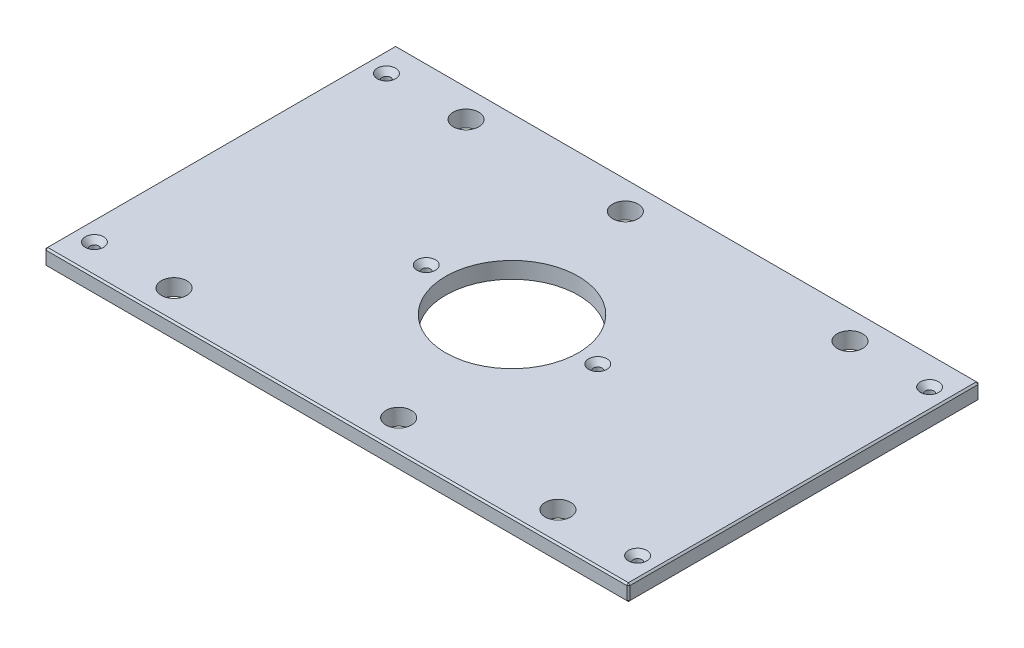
ISO-10303-21;
HEADER;
FILE_DESCRIPTION(('STEP AP214'),'2;1');
FILE_NAME('part.step','',(''),(''),'','','');
FILE_SCHEMA(('AUTOMOTIVE_DESIGN { 1 0 10303 214 1 1 1 1 }'));
ENDSEC;
DATA;
#1=APPLICATION_CONTEXT('core data for automotive mechanical design processes');
#2=APPLICATION_PROTOCOL_DEFINITION('international standard','automotive_design',2000,#1);
#3=PRODUCT_CONTEXT('',#1,'mechanical');
#4=PRODUCT('Part','Part','',(#3));
#5=PRODUCT_RELATED_PRODUCT_CATEGORY('part','',(#4));
#6=PRODUCT_DEFINITION_FORMATION('','',#4);
#7=PRODUCT_DEFINITION_CONTEXT('part definition',#1,'design');
#8=PRODUCT_DEFINITION('design','',#6,#7);
#9=PRODUCT_DEFINITION_SHAPE('','',#8);
#10=(LENGTH_UNIT() NAMED_UNIT(*) SI_UNIT(.MILLI.,.METRE.));
#11=(NAMED_UNIT(*) PLANE_ANGLE_UNIT() SI_UNIT($,.RADIAN.));
#12=(NAMED_UNIT(*) SI_UNIT($,.STERADIAN.) SOLID_ANGLE_UNIT());
#13=UNCERTAINTY_MEASURE_WITH_UNIT(LENGTH_MEASURE(1.E-05),#10,'distance_accuracy_value','');
#14=(GEOMETRIC_REPRESENTATION_CONTEXT(3) GLOBAL_UNCERTAINTY_ASSIGNED_CONTEXT((#13)) GLOBAL_UNIT_ASSIGNED_CONTEXT((#10,
#11,#12)) REPRESENTATION_CONTEXT('',''));
#15=CARTESIAN_POINT('',(0.,0.,0.));
#16=DIRECTION('',(0.,0.,1.));
#17=DIRECTION('',(1.,0.,0.));
#18=AXIS2_PLACEMENT_3D('',#15,#16,#17);
#19=CARTESIAN_POINT('',(-227.0125,12.7,-136.525));
#20=DIRECTION('',(1.,0.,0.));
#21=DIRECTION('',(0.,0.,-1.));
#22=AXIS2_PLACEMENT_3D('',#19,#20,#21);
#23=PLANE('',#22);
#24=DIRECTION('',(0.,0.,-1.));
#25=VECTOR('',#24,1.);
#26=CARTESIAN_POINT('',(-227.0125,11.4300000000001,-136.525));
#27=LINE('',#26,#25);
#28=CARTESIAN_POINT('',(-227.0125,11.4300000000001,135.255));
#29=VERTEX_POINT('',#28);
#30=CARTESIAN_POINT('',(-227.0125,11.4300000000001,-135.255));
#31=VERTEX_POINT('',#30);
#32=EDGE_CURVE('E135',#29,#31,#27,.T.);
#33=ORIENTED_EDGE('',*,*,#32,.T.);
#34=DIRECTION('',(0.,-1.,0.));
#35=VECTOR('',#34,1.);
#36=CARTESIAN_POINT('',(-227.0125,12.7,-135.255));
#37=LINE('',#36,#35);
#38=CARTESIAN_POINT('',(-227.0125,1.26999999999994,-135.255));
#39=VERTEX_POINT('',#38);
#40=EDGE_CURVE('E131',#31,#39,#37,.T.);
#41=ORIENTED_EDGE('',*,*,#40,.T.);
#42=DIRECTION('',(0.,0.,1.));
#43=VECTOR('',#42,1.);
#44=CARTESIAN_POINT('',(-227.0125,1.26999999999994,-136.525));
#45=LINE('',#44,#43);
#46=CARTESIAN_POINT('',(-227.0125,1.26999999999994,135.255));
#47=VERTEX_POINT('',#46);
#48=EDGE_CURVE('E126',#39,#47,#45,.T.);
#49=ORIENTED_EDGE('',*,*,#48,.T.);
#50=DIRECTION('',(0.,1.,0.));
#51=VECTOR('',#50,1.);
#52=CARTESIAN_POINT('',(-227.0125,12.7,135.255));
#53=LINE('',#52,#51);
#54=EDGE_CURVE('E128',#47,#29,#53,.T.);
#55=ORIENTED_EDGE('',*,*,#54,.T.);
#56=EDGE_LOOP('',(#33,#41,#49,#55));
#57=FACE_BOUND('',#56,.T.);
#58=ADVANCED_FACE('F35',(#57),#23,.F.);
#59=CARTESIAN_POINT('',(-227.0125,12.7,136.525));
#60=DIRECTION('',(0.,0.,-1.));
#61=DIRECTION('',(-1.,0.,0.));
#62=AXIS2_PLACEMENT_3D('',#59,#60,#61);
#63=PLANE('',#62);
#64=DIRECTION('',(1.,0.,0.));
#65=VECTOR('',#64,1.);
#66=CARTESIAN_POINT('',(-227.0125,1.26999999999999,136.525));
#67=LINE('',#66,#65);
#68=CARTESIAN_POINT('',(-225.7425,1.26999999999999,136.525));
#69=VERTEX_POINT('',#68);
#70=CARTESIAN_POINT('',(225.7425,1.26999999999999,136.525));
#71=VERTEX_POINT('',#70);
#72=EDGE_CURVE('E58',#69,#71,#67,.T.);
#73=ORIENTED_EDGE('',*,*,#72,.T.);
#74=DIRECTION('',(0.,1.,0.));
#75=VECTOR('',#74,1.);
#76=CARTESIAN_POINT('',(225.7425,12.7,136.525));
#77=LINE('',#76,#75);
#78=CARTESIAN_POINT('',(225.7425,11.43,136.525));
#79=VERTEX_POINT('',#78);
#80=EDGE_CURVE('E11',#71,#79,#77,.T.);
#81=ORIENTED_EDGE('',*,*,#80,.T.);
#82=DIRECTION('',(-1.,0.,0.));
#83=VECTOR('',#82,1.);
#84=CARTESIAN_POINT('',(-227.0125,11.43,136.525));
#85=LINE('',#84,#83);
#86=CARTESIAN_POINT('',(-225.7425,11.43,136.525));
#87=VERTEX_POINT('',#86);
#88=EDGE_CURVE('E44',#79,#87,#85,.T.);
#89=ORIENTED_EDGE('',*,*,#88,.T.);
#90=DIRECTION('',(0.,-1.,0.));
#91=VECTOR('',#90,1.);
#92=CARTESIAN_POINT('',(-225.7425,12.7,136.525));
#93=LINE('',#92,#91);
#94=EDGE_CURVE('E291',#87,#69,#93,.T.);
#95=ORIENTED_EDGE('',*,*,#94,.T.);
#96=EDGE_LOOP('',(#73,#81,#89,#95));
#97=FACE_BOUND('',#96,.T.);
#98=ADVANCED_FACE('F360',(#97),#63,.F.);
#99=CARTESIAN_POINT('',(227.0125,12.7,-136.525));
#100=DIRECTION('',(-1.,0.,0.));
#101=DIRECTION('',(0.,0.,1.));
#102=AXIS2_PLACEMENT_3D('',#99,#100,#101);
#103=PLANE('',#102);
#104=DIRECTION('',(0.,0.,-1.));
#105=VECTOR('',#104,1.);
#106=CARTESIAN_POINT('',(227.0125,1.26999999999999,-136.525));
#107=LINE('',#106,#105);
#108=CARTESIAN_POINT('',(227.0125,1.26999999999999,135.255));
#109=VERTEX_POINT('',#108);
#110=CARTESIAN_POINT('',(227.0125,1.26999999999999,-135.255));
#111=VERTEX_POINT('',#110);
#112=EDGE_CURVE('E286',#109,#111,#107,.T.);
#113=ORIENTED_EDGE('',*,*,#112,.T.);
#114=DIRECTION('',(0.,1.,0.));
#115=VECTOR('',#114,1.);
#116=CARTESIAN_POINT('',(227.0125,12.7,-135.255));
#117=LINE('',#116,#115);
#118=CARTESIAN_POINT('',(227.0125,11.4300000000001,-135.255));
#119=VERTEX_POINT('',#118);
#120=EDGE_CURVE('E288',#111,#119,#117,.T.);
#121=ORIENTED_EDGE('',*,*,#120,.T.);
#122=DIRECTION('',(0.,0.,1.));
#123=VECTOR('',#122,1.);
#124=CARTESIAN_POINT('',(227.0125,11.4300000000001,136.525));
#125=LINE('',#124,#123);
#126=CARTESIAN_POINT('',(227.0125,11.4300000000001,135.255));
#127=VERTEX_POINT('',#126);
#128=EDGE_CURVE('E284',#119,#127,#125,.T.);
#129=ORIENTED_EDGE('',*,*,#128,.T.);
#130=DIRECTION('',(0.,-1.,0.));
#131=VECTOR('',#130,1.);
#132=CARTESIAN_POINT('',(227.0125,12.7,135.255));
#133=LINE('',#132,#131);
#134=EDGE_CURVE('E282',#127,#109,#133,.T.);
#135=ORIENTED_EDGE('',*,*,#134,.T.);
#136=EDGE_LOOP('',(#113,#121,#129,#135));
#137=FACE_BOUND('',#136,.T.);
#138=ADVANCED_FACE('F347',(#137),#103,.F.);
#139=CARTESIAN_POINT('',(-227.0125,12.7,-136.525));
#140=DIRECTION('',(0.,0.,1.));
#141=DIRECTION('',(1.,0.,0.));
#142=AXIS2_PLACEMENT_3D('',#139,#140,#141);
#143=PLANE('',#142);
#144=DIRECTION('',(-1.,0.,0.));
#145=VECTOR('',#144,1.);
#146=CARTESIAN_POINT('',(-227.0125,1.26999999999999,-136.525));
#147=LINE('',#146,#145);
#148=CARTESIAN_POINT('',(225.7425,1.26999999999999,-136.525));
#149=VERTEX_POINT('',#148);
#150=CARTESIAN_POINT('',(-225.7425,1.26999999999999,-136.525));
#151=VERTEX_POINT('',#150);
#152=EDGE_CURVE('E258',#149,#151,#147,.T.);
#153=ORIENTED_EDGE('',*,*,#152,.T.);
#154=DIRECTION('',(0.,1.,0.));
#155=VECTOR('',#154,1.);
#156=CARTESIAN_POINT('',(-225.7425,12.7,-136.525));
#157=LINE('',#156,#155);
#158=CARTESIAN_POINT('',(-225.7425,11.4300000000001,-136.525));
#159=VERTEX_POINT('',#158);
#160=EDGE_CURVE('E262',#151,#159,#157,.T.);
#161=ORIENTED_EDGE('',*,*,#160,.T.);
#162=DIRECTION('',(1.,0.,0.));
#163=VECTOR('',#162,1.);
#164=CARTESIAN_POINT('',(227.0125,11.4300000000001,-136.525));
#165=LINE('',#164,#163);
#166=CARTESIAN_POINT('',(225.7425,11.4300000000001,-136.525));
#167=VERTEX_POINT('',#166);
#168=EDGE_CURVE('E260',#159,#167,#165,.T.);
#169=ORIENTED_EDGE('',*,*,#168,.T.);
#170=DIRECTION('',(0.,-1.,0.));
#171=VECTOR('',#170,1.);
#172=CARTESIAN_POINT('',(225.7425,12.7,-136.525));
#173=LINE('',#172,#171);
#174=EDGE_CURVE('E256',#167,#149,#173,.T.);
#175=ORIENTED_EDGE('',*,*,#174,.T.);
#176=EDGE_LOOP('',(#153,#161,#169,#175));
#177=FACE_BOUND('',#176,.T.);
#178=ADVANCED_FACE('F321',(#177),#143,.F.);
#179=CARTESIAN_POINT('',(0.,12.7,0.));
#180=DIRECTION('',(0.,1.,0.));
#181=DIRECTION('',(0.,0.,1.));
#182=AXIS2_PLACEMENT_3D('',#179,#180,#181);
#183=PLANE('',#182);
#184=CARTESIAN_POINT('',(211.1375,12.7,-113.50498));
#185=DIRECTION('',(0.,1.,0.));
#186=DIRECTION('',(0.,0.,1.));
#187=AXIS2_PLACEMENT_3D('',#184,#185,#186);
#188=CIRCLE('',#187,7.13739999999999);
#189=CARTESIAN_POINT('',(211.1375,12.7,-106.36758));
#190=VERTEX_POINT('',#189);
#191=EDGE_CURVE('E784',#190,#190,#188,.T.);
#192=ORIENTED_EDGE('',*,*,#191,.F.);
#193=EDGE_LOOP('',(#192));
#194=FACE_BOUND('',#193,.T.);
#195=CARTESIAN_POINT('',(211.1375,12.7,113.50498));
#196=DIRECTION('',(0.,1.,0.));
#197=DIRECTION('',(0.,0.,1.));
#198=AXIS2_PLACEMENT_3D('',#195,#196,#197);
#199=CIRCLE('',#198,7.13739999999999);
#200=CARTESIAN_POINT('',(211.1375,12.7,120.64238));
#201=VERTEX_POINT('',#200);
#202=EDGE_CURVE('E788',#201,#201,#199,.T.);
#203=ORIENTED_EDGE('',*,*,#202,.F.);
#204=EDGE_LOOP('',(#203));
#205=FACE_BOUND('',#204,.T.);
#206=CARTESIAN_POINT('',(-211.1375,12.7,113.50498));
#207=DIRECTION('',(0.,1.,0.));
#208=DIRECTION('',(0.,0.,1.));
#209=AXIS2_PLACEMENT_3D('',#206,#207,#208);
#210=CIRCLE('',#209,7.13739999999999);
#211=CARTESIAN_POINT('',(-211.1375,12.7,120.64238));
#212=VERTEX_POINT('',#211);
#213=EDGE_CURVE('E792',#212,#212,#210,.T.);
#214=ORIENTED_EDGE('',*,*,#213,.F.);
#215=EDGE_LOOP('',(#214));
#216=FACE_BOUND('',#215,.T.);
#217=CARTESIAN_POINT('',(-66.675,12.7,0.));
#218=DIRECTION('',(0.,1.,0.));
#219=DIRECTION('',(0.,0.,1.));
#220=AXIS2_PLACEMENT_3D('',#217,#218,#219);
#221=CIRCLE('',#220,7.1374);
#222=CARTESIAN_POINT('',(-66.675,12.7,7.1374));
#223=VERTEX_POINT('',#222);
#224=EDGE_CURVE('E796',#223,#223,#221,.T.);
#225=ORIENTED_EDGE('',*,*,#224,.F.);
#226=EDGE_LOOP('',(#225));
#227=FACE_BOUND('',#226,.T.);
#228=CARTESIAN_POINT('',(66.675,12.7,0.));
#229=DIRECTION('',(0.,1.,0.));
#230=DIRECTION('',(0.,0.,1.));
#231=AXIS2_PLACEMENT_3D('',#228,#229,#230);
#232=CIRCLE('',#231,7.1374);
#233=CARTESIAN_POINT('',(66.675,12.7,7.1374));
#234=VERTEX_POINT('',#233);
#235=EDGE_CURVE('E800',#234,#234,#232,.T.);
#236=ORIENTED_EDGE('',*,*,#235,.F.);
#237=EDGE_LOOP('',(#236));
#238=FACE_BOUND('',#237,.T.);
#239=CARTESIAN_POINT('',(-211.1375,12.7,-113.50498));
#240=DIRECTION('',(0.,1.,0.));
#241=DIRECTION('',(0.,0.,1.));
#242=AXIS2_PLACEMENT_3D('',#239,#240,#241);
#243=CIRCLE('',#242,7.13739999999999);
#244=CARTESIAN_POINT('',(-211.1375,12.7,-106.36758));
#245=VERTEX_POINT('',#244);
#246=EDGE_CURVE('E803',#245,#245,#243,.T.);
#247=ORIENTED_EDGE('',*,*,#246,.F.);
#248=EDGE_LOOP('',(#247));
#249=FACE_BOUND('',#248,.T.);
#250=DIRECTION('',(0.,0.,-1.));
#251=VECTOR('',#250,1.);
#252=CARTESIAN_POINT('',(225.7425,12.7,-136.525));
#253=LINE('',#252,#251);
#254=CARTESIAN_POINT('',(225.7425,12.7,135.255));
#255=VERTEX_POINT('',#254);
#256=CARTESIAN_POINT('',(225.7425,12.7,-135.255));
#257=VERTEX_POINT('',#256);
#258=EDGE_CURVE('E269',#255,#257,#253,.T.);
#259=ORIENTED_EDGE('',*,*,#258,.T.);
#260=DIRECTION('',(-1.,0.,0.));
#261=VECTOR('',#260,1.);
#262=CARTESIAN_POINT('',(-227.0125,12.7,-135.255));
#263=LINE('',#262,#261);
#264=CARTESIAN_POINT('',(-225.7425,12.7,-135.255));
#265=VERTEX_POINT('',#264);
#266=EDGE_CURVE('E271',#257,#265,#263,.T.);
#267=ORIENTED_EDGE('',*,*,#266,.T.);
#268=DIRECTION('',(0.,0.,1.));
#269=VECTOR('',#268,1.);
#270=CARTESIAN_POINT('',(-225.7425,12.7,136.525));
#271=LINE('',#270,#269);
#272=CARTESIAN_POINT('',(-225.7425,12.7,135.255));
#273=VERTEX_POINT('',#272);
#274=EDGE_CURVE('E267',#265,#273,#271,.T.);
#275=ORIENTED_EDGE('',*,*,#274,.T.);
#276=DIRECTION('',(1.,0.,0.));
#277=VECTOR('',#276,1.);
#278=CARTESIAN_POINT('',(227.0125,12.7,135.255));
#279=LINE('',#278,#277);
#280=EDGE_CURVE('E265',#273,#255,#279,.T.);
#281=ORIENTED_EDGE('',*,*,#280,.T.);
#282=EDGE_LOOP('',(#259,#267,#275,#281));
#283=FACE_BOUND('',#282,.T.);
#284=CARTESIAN_POINT('',(149.225,12.7,-113.50498));
#285=DIRECTION('',(0.,1.,0.));
#286=DIRECTION('',(0.,0.,1.));
#287=AXIS2_PLACEMENT_3D('',#284,#285,#286);
#288=CIRCLE('',#287,9.921875);
#289=CARTESIAN_POINT('',(149.225,12.7,-103.583105));
#290=VERTEX_POINT('',#289);
#291=EDGE_CURVE('E204',#290,#290,#288,.T.);
#292=ORIENTED_EDGE('',*,*,#291,.F.);
#293=EDGE_LOOP('',(#292));
#294=FACE_BOUND('',#293,.T.);
#295=CARTESIAN_POINT('',(-149.225,12.7,-113.50498));
#296=DIRECTION('',(0.,1.,0.));
#297=DIRECTION('',(0.,0.,1.));
#298=AXIS2_PLACEMENT_3D('',#295,#296,#297);
#299=CIRCLE('',#298,9.921875);
#300=CARTESIAN_POINT('',(-149.225,12.7,-103.583105));
#301=VERTEX_POINT('',#300);
#302=EDGE_CURVE('E214',#301,#301,#299,.T.);
#303=ORIENTED_EDGE('',*,*,#302,.F.);
#304=EDGE_LOOP('',(#303));
#305=FACE_BOUND('',#304,.T.);
#306=CARTESIAN_POINT('',(149.225,12.7,113.50498));
#307=DIRECTION('',(0.,1.,0.));
#308=DIRECTION('',(0.,0.,1.));
#309=AXIS2_PLACEMENT_3D('',#306,#307,#308);
#310=CIRCLE('',#309,9.921875);
#311=CARTESIAN_POINT('',(149.225,12.7,123.426855));
#312=VERTEX_POINT('',#311);
#313=EDGE_CURVE('E225',#312,#312,#310,.T.);
#314=ORIENTED_EDGE('',*,*,#313,.F.);
#315=EDGE_LOOP('',(#314));
#316=FACE_BOUND('',#315,.T.);
#317=CARTESIAN_POINT('',(-149.225,12.7,113.50498));
#318=DIRECTION('',(0.,1.,0.));
#319=DIRECTION('',(0.,0.,1.));
#320=AXIS2_PLACEMENT_3D('',#317,#318,#319);
#321=CIRCLE('',#320,9.921875);
#322=CARTESIAN_POINT('',(-149.225,12.7,123.426855));
#323=VERTEX_POINT('',#322);
#324=EDGE_CURVE('E231',#323,#323,#321,.T.);
#325=ORIENTED_EDGE('',*,*,#324,.F.);
#326=EDGE_LOOP('',(#325));
#327=FACE_BOUND('',#326,.T.);
#328=CARTESIAN_POINT('',(-25.4,12.7,-113.50498));
#329=DIRECTION('',(0.,1.,0.));
#330=DIRECTION('',(0.,0.,1.));
#331=AXIS2_PLACEMENT_3D('',#328,#329,#330);
#332=CIRCLE('',#331,9.921875);
#333=CARTESIAN_POINT('',(-25.4,12.7,-103.583105));
#334=VERTEX_POINT('',#333);
#335=EDGE_CURVE('E237',#334,#334,#332,.T.);
#336=ORIENTED_EDGE('',*,*,#335,.F.);
#337=EDGE_LOOP('',(#336));
#338=FACE_BOUND('',#337,.T.);
#339=CARTESIAN_POINT('',(25.4,12.7,113.50498));
#340=DIRECTION('',(0.,1.,0.));
#341=DIRECTION('',(0.,0.,1.));
#342=AXIS2_PLACEMENT_3D('',#339,#340,#341);
#343=CIRCLE('',#342,9.921875);
#344=CARTESIAN_POINT('',(25.4,12.7,123.426855));
#345=VERTEX_POINT('',#344);
#346=EDGE_CURVE('E243',#345,#345,#343,.T.);
#347=ORIENTED_EDGE('',*,*,#346,.F.);
#348=EDGE_LOOP('',(#347));
#349=FACE_BOUND('',#348,.T.);
#350=CARTESIAN_POINT('',(0.,12.7,0.));
#351=DIRECTION('',(0.,1.,0.));
#352=DIRECTION('',(0.,0.,1.));
#353=AXIS2_PLACEMENT_3D('',#350,#351,#352);
#354=CIRCLE('',#353,51.562);
#355=CARTESIAN_POINT('',(0.,12.7,51.562));
#356=VERTEX_POINT('',#355);
#357=EDGE_CURVE('E249',#356,#356,#354,.T.);
#358=ORIENTED_EDGE('',*,*,#357,.F.);
#359=EDGE_LOOP('',(#358));
#360=FACE_BOUND('',#359,.T.);
#361=ADVANCED_FACE('F369',(#194,#205,#216,#227,#238,#249,#283,#294,#305,#316,#327,#338,#349,
#360),#183,.T.);
#362=CARTESIAN_POINT('',(0.,0.,0.));
#363=DIRECTION('',(0.,1.,0.));
#364=DIRECTION('',(0.,0.,1.));
#365=AXIS2_PLACEMENT_3D('',#362,#363,#364);
#366=PLANE('',#365);
#367=CARTESIAN_POINT('',(211.1375,0.,-113.50498));
#368=DIRECTION('',(0.,1.,0.));
#369=DIRECTION('',(0.,0.,1.));
#370=AXIS2_PLACEMENT_3D('',#367,#368,#369);
#371=CIRCLE('',#370,3.3782);
#372=CARTESIAN_POINT('',(211.1375,0.,-110.12678));
#373=VERTEX_POINT('',#372);
#374=EDGE_CURVE('E837',#373,#373,#371,.T.);
#375=ORIENTED_EDGE('',*,*,#374,.T.);
#376=EDGE_LOOP('',(#375));
#377=FACE_BOUND('',#376,.T.);
#378=CARTESIAN_POINT('',(211.1375,0.,113.50498));
#379=DIRECTION('',(0.,1.,0.));
#380=DIRECTION('',(0.,0.,1.));
#381=AXIS2_PLACEMENT_3D('',#378,#379,#380);
#382=CIRCLE('',#381,3.3782);
#383=CARTESIAN_POINT('',(211.1375,0.,116.88318));
#384=VERTEX_POINT('',#383);
#385=EDGE_CURVE('E830',#384,#384,#382,.T.);
#386=ORIENTED_EDGE('',*,*,#385,.T.);
#387=EDGE_LOOP('',(#386));
#388=FACE_BOUND('',#387,.T.);
#389=CARTESIAN_POINT('',(-211.1375,0.,113.50498));
#390=DIRECTION('',(0.,1.,0.));
#391=DIRECTION('',(0.,0.,1.));
#392=AXIS2_PLACEMENT_3D('',#389,#390,#391);
#393=CIRCLE('',#392,3.3782);
#394=CARTESIAN_POINT('',(-211.1375,0.,116.88318));
#395=VERTEX_POINT('',#394);
#396=EDGE_CURVE('E823',#395,#395,#393,.T.);
#397=ORIENTED_EDGE('',*,*,#396,.T.);
#398=EDGE_LOOP('',(#397));
#399=FACE_BOUND('',#398,.T.);
#400=CARTESIAN_POINT('',(-66.675,0.,0.));
#401=DIRECTION('',(0.,1.,0.));
#402=DIRECTION('',(0.,0.,1.));
#403=AXIS2_PLACEMENT_3D('',#400,#401,#402);
#404=CIRCLE('',#403,3.3782);
#405=CARTESIAN_POINT('',(-66.675,0.,3.3782));
#406=VERTEX_POINT('',#405);
#407=EDGE_CURVE('E816',#406,#406,#404,.T.);
#408=ORIENTED_EDGE('',*,*,#407,.T.);
#409=EDGE_LOOP('',(#408));
#410=FACE_BOUND('',#409,.T.);
#411=CARTESIAN_POINT('',(66.675,0.,0.));
#412=DIRECTION('',(0.,1.,0.));
#413=DIRECTION('',(0.,0.,1.));
#414=AXIS2_PLACEMENT_3D('',#411,#412,#413);
#415=CIRCLE('',#414,3.3782);
#416=CARTESIAN_POINT('',(66.675,0.,3.3782));
#417=VERTEX_POINT('',#416);
#418=EDGE_CURVE('E806',#417,#417,#415,.T.);
#419=ORIENTED_EDGE('',*,*,#418,.T.);
#420=EDGE_LOOP('',(#419));
#421=FACE_BOUND('',#420,.T.);
#422=CARTESIAN_POINT('',(-211.1375,0.,-113.50498));
#423=DIRECTION('',(0.,1.,0.));
#424=DIRECTION('',(0.,0.,1.));
#425=AXIS2_PLACEMENT_3D('',#422,#423,#424);
#426=CIRCLE('',#425,3.3782);
#427=CARTESIAN_POINT('',(-211.1375,0.,-110.12678));
#428=VERTEX_POINT('',#427);
#429=EDGE_CURVE('E217',#428,#428,#426,.T.);
#430=ORIENTED_EDGE('',*,*,#429,.T.);
#431=EDGE_LOOP('',(#430));
#432=FACE_BOUND('',#431,.T.);
#433=DIRECTION('',(0.,0.,-1.));
#434=VECTOR('',#433,1.);
#435=CARTESIAN_POINT('',(-225.7425,0.,0.));
#436=LINE('',#435,#434);
#437=CARTESIAN_POINT('',(-225.7425,0.,135.255));
#438=VERTEX_POINT('',#437);
#439=CARTESIAN_POINT('',(-225.7425,0.,-135.255));
#440=VERTEX_POINT('',#439);
#441=EDGE_CURVE('E158',#438,#440,#436,.T.);
#442=ORIENTED_EDGE('',*,*,#441,.T.);
#443=DIRECTION('',(1.,0.,0.));
#444=VECTOR('',#443,1.);
#445=CARTESIAN_POINT('',(0.,0.,-135.255));
#446=LINE('',#445,#444);
#447=CARTESIAN_POINT('',(225.7425,0.,-135.255));
#448=VERTEX_POINT('',#447);
#449=EDGE_CURVE('E279',#440,#448,#446,.T.);
#450=ORIENTED_EDGE('',*,*,#449,.T.);
#451=DIRECTION('',(0.,0.,1.));
#452=VECTOR('',#451,1.);
#453=CARTESIAN_POINT('',(225.7425,0.,0.));
#454=LINE('',#453,#452);
#455=CARTESIAN_POINT('',(225.7425,0.,135.255));
#456=VERTEX_POINT('',#455);
#457=EDGE_CURVE('E277',#448,#456,#454,.T.);
#458=ORIENTED_EDGE('',*,*,#457,.T.);
#459=DIRECTION('',(-1.,0.,0.));
#460=VECTOR('',#459,1.);
#461=CARTESIAN_POINT('',(0.,0.,135.255));
#462=LINE('',#461,#460);
#463=EDGE_CURVE('E274',#456,#438,#462,.T.);
#464=ORIENTED_EDGE('',*,*,#463,.T.);
#465=EDGE_LOOP('',(#442,#450,#458,#464));
#466=FACE_BOUND('',#465,.T.);
#467=CARTESIAN_POINT('',(149.225,0.,-113.50498));
#468=DIRECTION('',(0.,1.,0.));
#469=DIRECTION('',(0.,0.,1.));
#470=AXIS2_PLACEMENT_3D('',#467,#468,#469);
#471=CIRCLE('',#470,9.921875);
#472=CARTESIAN_POINT('',(149.225,0.,-103.583105));
#473=VERTEX_POINT('',#472);
#474=EDGE_CURVE('E209',#473,#473,#471,.T.);
#475=ORIENTED_EDGE('',*,*,#474,.T.);
#476=EDGE_LOOP('',(#475));
#477=FACE_BOUND('',#476,.T.);
#478=CARTESIAN_POINT('',(-149.225,0.,-113.50498));
#479=DIRECTION('',(0.,1.,0.));
#480=DIRECTION('',(0.,0.,1.));
#481=AXIS2_PLACEMENT_3D('',#478,#479,#480);
#482=CIRCLE('',#481,9.921875);
#483=CARTESIAN_POINT('',(-149.225,0.,-103.583105));
#484=VERTEX_POINT('',#483);
#485=EDGE_CURVE('E222',#484,#484,#482,.T.);
#486=ORIENTED_EDGE('',*,*,#485,.T.);
#487=EDGE_LOOP('',(#486));
#488=FACE_BOUND('',#487,.T.);
#489=CARTESIAN_POINT('',(149.225,0.,113.50498));
#490=DIRECTION('',(0.,1.,0.));
#491=DIRECTION('',(0.,0.,1.));
#492=AXIS2_PLACEMENT_3D('',#489,#490,#491);
#493=CIRCLE('',#492,9.921875);
#494=CARTESIAN_POINT('',(149.225,0.,123.426855));
#495=VERTEX_POINT('',#494);
#496=EDGE_CURVE('E228',#495,#495,#493,.T.);
#497=ORIENTED_EDGE('',*,*,#496,.T.);
#498=EDGE_LOOP('',(#497));
#499=FACE_BOUND('',#498,.T.);
#500=CARTESIAN_POINT('',(-149.225,0.,113.50498));
#501=DIRECTION('',(0.,1.,0.));
#502=DIRECTION('',(0.,0.,1.));
#503=AXIS2_PLACEMENT_3D('',#500,#501,#502);
#504=CIRCLE('',#503,9.921875);
#505=CARTESIAN_POINT('',(-149.225,0.,123.426855));
#506=VERTEX_POINT('',#505);
#507=EDGE_CURVE('E234',#506,#506,#504,.T.);
#508=ORIENTED_EDGE('',*,*,#507,.T.);
#509=EDGE_LOOP('',(#508));
#510=FACE_BOUND('',#509,.T.);
#511=CARTESIAN_POINT('',(-25.4,0.,-113.50498));
#512=DIRECTION('',(0.,1.,0.));
#513=DIRECTION('',(0.,0.,1.));
#514=AXIS2_PLACEMENT_3D('',#511,#512,#513);
#515=CIRCLE('',#514,9.921875);
#516=CARTESIAN_POINT('',(-25.4,0.,-103.583105));
#517=VERTEX_POINT('',#516);
#518=EDGE_CURVE('E240',#517,#517,#515,.T.);
#519=ORIENTED_EDGE('',*,*,#518,.T.);
#520=EDGE_LOOP('',(#519));
#521=FACE_BOUND('',#520,.T.);
#522=CARTESIAN_POINT('',(25.4,0.,113.50498));
#523=DIRECTION('',(0.,1.,0.));
#524=DIRECTION('',(0.,0.,1.));
#525=AXIS2_PLACEMENT_3D('',#522,#523,#524);
#526=CIRCLE('',#525,9.921875);
#527=CARTESIAN_POINT('',(25.4,0.,123.426855));
#528=VERTEX_POINT('',#527);
#529=EDGE_CURVE('E246',#528,#528,#526,.T.);
#530=ORIENTED_EDGE('',*,*,#529,.T.);
#531=EDGE_LOOP('',(#530));
#532=FACE_BOUND('',#531,.T.);
#533=CARTESIAN_POINT('',(0.,0.,0.));
#534=DIRECTION('',(0.,1.,0.));
#535=DIRECTION('',(0.,0.,1.));
#536=AXIS2_PLACEMENT_3D('',#533,#534,#535);
#537=CIRCLE('',#536,51.562);
#538=CARTESIAN_POINT('',(0.,0.,51.562));
#539=VERTEX_POINT('',#538);
#540=EDGE_CURVE('E147',#539,#539,#537,.T.);
#541=ORIENTED_EDGE('',*,*,#540,.T.);
#542=EDGE_LOOP('',(#541));
#543=FACE_BOUND('',#542,.T.);
#544=ADVANCED_FACE('F334',(#377,#388,#399,#410,#421,#432,#466,#477,#488,#499,#510,#521,#532,
#543),#366,.F.);
#545=CARTESIAN_POINT('',(0.,0.,0.));
#546=DIRECTION('',(0.,1.,0.));
#547=DIRECTION('',(0.,0.,1.));
#548=AXIS2_PLACEMENT_3D('',#545,#546,#547);
#549=CYLINDRICAL_SURFACE('',#548,51.562);
#550=ORIENTED_EDGE('',*,*,#540,.F.);
#551=EDGE_LOOP('',(#550));
#552=FACE_BOUND('',#551,.T.);
#553=ORIENTED_EDGE('',*,*,#357,.T.);
#554=EDGE_LOOP('',(#553));
#555=FACE_BOUND('',#554,.T.);
#556=ADVANCED_FACE('F721',(#552,#555),#549,.F.);
#557=CARTESIAN_POINT('',(25.4,12.7,113.50498));
#558=DIRECTION('',(0.,1.,0.));
#559=DIRECTION('',(0.,0.,1.));
#560=AXIS2_PLACEMENT_3D('',#557,#558,#559);
#561=CYLINDRICAL_SURFACE('',#560,9.921875);
#562=ORIENTED_EDGE('',*,*,#529,.F.);
#563=EDGE_LOOP('',(#562));
#564=FACE_BOUND('',#563,.T.);
#565=ORIENTED_EDGE('',*,*,#346,.T.);
#566=EDGE_LOOP('',(#565));
#567=FACE_BOUND('',#566,.T.);
#568=ADVANCED_FACE('F712',(#564,#567),#561,.F.);
#569=CARTESIAN_POINT('',(-25.4,12.7,-113.50498));
#570=DIRECTION('',(0.,1.,0.));
#571=DIRECTION('',(0.,0.,1.));
#572=AXIS2_PLACEMENT_3D('',#569,#570,#571);
#573=CYLINDRICAL_SURFACE('',#572,9.921875);
#574=ORIENTED_EDGE('',*,*,#518,.F.);
#575=EDGE_LOOP('',(#574));
#576=FACE_BOUND('',#575,.T.);
#577=ORIENTED_EDGE('',*,*,#335,.T.);
#578=EDGE_LOOP('',(#577));
#579=FACE_BOUND('',#578,.T.);
#580=ADVANCED_FACE('F703',(#576,#579),#573,.F.);
#581=CARTESIAN_POINT('',(-149.225,12.7,113.50498));
#582=DIRECTION('',(0.,1.,0.));
#583=DIRECTION('',(0.,0.,1.));
#584=AXIS2_PLACEMENT_3D('',#581,#582,#583);
#585=CYLINDRICAL_SURFACE('',#584,9.921875);
#586=ORIENTED_EDGE('',*,*,#507,.F.);
#587=EDGE_LOOP('',(#586));
#588=FACE_BOUND('',#587,.T.);
#589=ORIENTED_EDGE('',*,*,#324,.T.);
#590=EDGE_LOOP('',(#589));
#591=FACE_BOUND('',#590,.T.);
#592=ADVANCED_FACE('F694',(#588,#591),#585,.F.);
#593=CARTESIAN_POINT('',(149.225,12.7,113.50498));
#594=DIRECTION('',(0.,1.,0.));
#595=DIRECTION('',(0.,0.,1.));
#596=AXIS2_PLACEMENT_3D('',#593,#594,#595);
#597=CYLINDRICAL_SURFACE('',#596,9.921875);
#598=ORIENTED_EDGE('',*,*,#496,.F.);
#599=EDGE_LOOP('',(#598));
#600=FACE_BOUND('',#599,.T.);
#601=ORIENTED_EDGE('',*,*,#313,.T.);
#602=EDGE_LOOP('',(#601));
#603=FACE_BOUND('',#602,.T.);
#604=ADVANCED_FACE('F685',(#600,#603),#597,.F.);
#605=CARTESIAN_POINT('',(-149.225,12.7,-113.50498));
#606=DIRECTION('',(0.,1.,0.));
#607=DIRECTION('',(0.,0.,1.));
#608=AXIS2_PLACEMENT_3D('',#605,#606,#607);
#609=CYLINDRICAL_SURFACE('',#608,9.921875);
#610=ORIENTED_EDGE('',*,*,#485,.F.);
#611=EDGE_LOOP('',(#610));
#612=FACE_BOUND('',#611,.T.);
#613=ORIENTED_EDGE('',*,*,#302,.T.);
#614=EDGE_LOOP('',(#613));
#615=FACE_BOUND('',#614,.T.);
#616=ADVANCED_FACE('F675',(#612,#615),#609,.F.);
#617=CARTESIAN_POINT('',(149.225,12.7,-113.50498));
#618=DIRECTION('',(0.,1.,0.));
#619=DIRECTION('',(0.,0.,1.));
#620=AXIS2_PLACEMENT_3D('',#617,#618,#619);
#621=CYLINDRICAL_SURFACE('',#620,9.921875);
#622=ORIENTED_EDGE('',*,*,#474,.F.);
#623=EDGE_LOOP('',(#622));
#624=FACE_BOUND('',#623,.T.);
#625=ORIENTED_EDGE('',*,*,#291,.T.);
#626=EDGE_LOOP('',(#625));
#627=FACE_BOUND('',#626,.T.);
#628=ADVANCED_FACE('F378',(#624,#627),#621,.F.);
#629=CARTESIAN_POINT('',(227.0125,12.7,135.255));
#630=DIRECTION('',(-0.707106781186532,0.,-0.707106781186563));
#631=DIRECTION('',(0.,-1.,0.));
#632=AXIS2_PLACEMENT_3D('',#629,#630,#631);
#633=PLANE('',#632);
#634=DIRECTION('',(-0.707106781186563,0.,0.707106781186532));
#635=VECTOR('',#634,1.);
#636=CARTESIAN_POINT('',(227.0125,11.4300000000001,135.255));
#637=LINE('',#636,#635);
#638=EDGE_CURVE('E39',#79,#127,#637,.F.);
#639=ORIENTED_EDGE('',*,*,#638,.F.);
#640=ORIENTED_EDGE('',*,*,#80,.F.);
#641=DIRECTION('',(0.707106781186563,0.,-0.707106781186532));
#642=VECTOR('',#641,1.);
#643=CARTESIAN_POINT('',(226.3775,1.26999999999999,135.89));
#644=LINE('',#643,#642);
#645=EDGE_CURVE('E197',#109,#71,#644,.F.);
#646=ORIENTED_EDGE('',*,*,#645,.F.);
#647=ORIENTED_EDGE('',*,*,#134,.F.);
#648=EDGE_LOOP('',(#639,#640,#646,#647));
#649=FACE_BOUND('',#648,.T.);
#650=ADVANCED_FACE('F37',(#649),#633,.F.);
#651=CARTESIAN_POINT('',(227.0125,11.4300000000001,135.255));
#652=DIRECTION('',(0.577350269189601,0.577350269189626,0.577350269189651));
#653=DIRECTION('',(0.,-0.707106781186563,0.707106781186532));
#654=AXIS2_PLACEMENT_3D('',#651,#652,#653);
#655=PLANE('',#654);
#656=DIRECTION('',(0.,-0.707106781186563,0.707106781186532));
#657=VECTOR('',#656,1.);
#658=CARTESIAN_POINT('',(225.7425,12.065,135.89));
#659=LINE('',#658,#657);
#660=EDGE_CURVE('E193',#79,#255,#659,.F.);
#661=ORIENTED_EDGE('',*,*,#660,.F.);
#662=ORIENTED_EDGE('',*,*,#638,.T.);
#663=DIRECTION('',(-0.707106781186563,0.707106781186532,0.));
#664=VECTOR('',#663,1.);
#665=CARTESIAN_POINT('',(227.0125,11.4300000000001,135.255));
#666=LINE('',#665,#664);
#667=EDGE_CURVE('E195',#255,#127,#666,.F.);
#668=ORIENTED_EDGE('',*,*,#667,.F.);
#669=EDGE_LOOP('',(#661,#662,#668));
#670=FACE_BOUND('',#669,.T.);
#671=ADVANCED_FACE('F371',(#670),#655,.T.);
#672=CARTESIAN_POINT('',(225.7425,0.,135.255));
#673=DIRECTION('',(0.577350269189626,-0.577350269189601,0.577350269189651));
#674=DIRECTION('',(0.707106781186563,0.,-0.707106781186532));
#675=AXIS2_PLACEMENT_3D('',#672,#673,#674);
#676=PLANE('',#675);
#677=DIRECTION('',(-0.707106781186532,-0.707106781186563,0.));
#678=VECTOR('',#677,1.);
#679=CARTESIAN_POINT('',(225.7425,0.,135.255));
#680=LINE('',#679,#678);
#681=EDGE_CURVE('E187',#109,#456,#680,.T.);
#682=ORIENTED_EDGE('',*,*,#681,.F.);
#683=ORIENTED_EDGE('',*,*,#645,.T.);
#684=DIRECTION('',(0.,0.707106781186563,0.707106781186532));
#685=VECTOR('',#684,1.);
#686=CARTESIAN_POINT('',(225.7425,0.,135.255));
#687=LINE('',#686,#685);
#688=EDGE_CURVE('E190',#456,#71,#687,.T.);
#689=ORIENTED_EDGE('',*,*,#688,.F.);
#690=EDGE_LOOP('',(#682,#683,#689));
#691=FACE_BOUND('',#690,.T.);
#692=ADVANCED_FACE('F340',(#691),#676,.T.);
#693=CARTESIAN_POINT('',(225.7425,12.7,0.));
#694=DIRECTION('',(0.707106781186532,0.707106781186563,0.));
#695=DIRECTION('',(0.,0.,1.));
#696=AXIS2_PLACEMENT_3D('',#693,#694,#695);
#697=PLANE('',#696);
#698=ORIENTED_EDGE('',*,*,#667,.T.);
#699=ORIENTED_EDGE('',*,*,#128,.F.);
#700=DIRECTION('',(0.707106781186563,-0.707106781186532,0.));
#701=VECTOR('',#700,1.);
#702=CARTESIAN_POINT('',(226.3775,12.065,-135.255));
#703=LINE('',#702,#701);
#704=EDGE_CURVE('E182',#257,#119,#703,.T.);
#705=ORIENTED_EDGE('',*,*,#704,.F.);
#706=ORIENTED_EDGE('',*,*,#258,.F.);
#707=EDGE_LOOP('',(#698,#699,#705,#706));
#708=FACE_BOUND('',#707,.T.);
#709=ADVANCED_FACE('F357',(#708),#697,.T.);
#710=CARTESIAN_POINT('',(0.,12.7,135.255));
#711=DIRECTION('',(0.,0.707106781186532,0.707106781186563));
#712=DIRECTION('',(-1.,0.,0.));
#713=AXIS2_PLACEMENT_3D('',#710,#711,#712);
#714=PLANE('',#713);
#715=ORIENTED_EDGE('',*,*,#660,.T.);
#716=ORIENTED_EDGE('',*,*,#280,.F.);
#717=DIRECTION('',(0.,0.707106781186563,-0.707106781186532));
#718=VECTOR('',#717,1.);
#719=CARTESIAN_POINT('',(-225.7425,12.7,135.255));
#720=LINE('',#719,#718);
#721=EDGE_CURVE('E179',#87,#273,#720,.T.);
#722=ORIENTED_EDGE('',*,*,#721,.F.);
#723=ORIENTED_EDGE('',*,*,#88,.F.);
#724=EDGE_LOOP('',(#715,#716,#722,#723));
#725=FACE_BOUND('',#724,.T.);
#726=ADVANCED_FACE('F362',(#725),#714,.T.);
#727=CARTESIAN_POINT('',(-225.7425,12.7,136.525));
#728=DIRECTION('',(0.707106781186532,0.,-0.707106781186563));
#729=DIRECTION('',(0.,-1.,0.));
#730=AXIS2_PLACEMENT_3D('',#727,#728,#729);
#731=PLANE('',#730);
#732=DIRECTION('',(0.707106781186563,0.,0.707106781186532));
#733=VECTOR('',#732,1.);
#734=CARTESIAN_POINT('',(-227.0125,1.26999999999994,135.255));
#735=LINE('',#734,#733);
#736=EDGE_CURVE('E142',#69,#47,#735,.F.);
#737=ORIENTED_EDGE('',*,*,#736,.F.);
#738=ORIENTED_EDGE('',*,*,#94,.F.);
#739=DIRECTION('',(-0.707106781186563,0.,-0.707106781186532));
#740=VECTOR('',#739,1.);
#741=CARTESIAN_POINT('',(-226.3775,11.43,135.89));
#742=LINE('',#741,#740);
#743=EDGE_CURVE('E145',#29,#87,#742,.F.);
#744=ORIENTED_EDGE('',*,*,#743,.F.);
#745=ORIENTED_EDGE('',*,*,#54,.F.);
#746=EDGE_LOOP('',(#737,#738,#744,#745));
#747=FACE_BOUND('',#746,.T.);
#748=ADVANCED_FACE('F140',(#747),#731,.F.);
#749=CARTESIAN_POINT('',(-227.0125,1.26999999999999,136.525));
#750=DIRECTION('',(0.,0.707106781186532,-0.707106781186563));
#751=DIRECTION('',(1.,0.,0.));
#752=AXIS2_PLACEMENT_3D('',#749,#750,#751);
#753=PLANE('',#752);
#754=ORIENTED_EDGE('',*,*,#688,.T.);
#755=ORIENTED_EDGE('',*,*,#72,.F.);
#756=DIRECTION('',(0.,-0.707106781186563,-0.707106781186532));
#757=VECTOR('',#756,1.);
#758=CARTESIAN_POINT('',(-225.7425,0.634999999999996,135.89));
#759=LINE('',#758,#757);
#760=EDGE_CURVE('E155',#438,#69,#759,.F.);
#761=ORIENTED_EDGE('',*,*,#760,.F.);
#762=ORIENTED_EDGE('',*,*,#463,.F.);
#763=EDGE_LOOP('',(#754,#755,#761,#762));
#764=FACE_BOUND('',#763,.T.);
#765=ADVANCED_FACE('F339',(#764),#753,.F.);
#766=CARTESIAN_POINT('',(227.0125,1.26999999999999,-136.525));
#767=DIRECTION('',(-0.707106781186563,0.707106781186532,0.));
#768=DIRECTION('',(0.,0.,-1.));
#769=AXIS2_PLACEMENT_3D('',#766,#767,#768);
#770=PLANE('',#769);
#771=ORIENTED_EDGE('',*,*,#681,.T.);
#772=ORIENTED_EDGE('',*,*,#457,.F.);
#773=DIRECTION('',(0.707106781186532,0.707106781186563,0.));
#774=VECTOR('',#773,1.);
#775=CARTESIAN_POINT('',(225.7425,0.,-135.255));
#776=LINE('',#775,#774);
#777=EDGE_CURVE('E174',#111,#448,#776,.F.);
#778=ORIENTED_EDGE('',*,*,#777,.F.);
#779=ORIENTED_EDGE('',*,*,#112,.F.);
#780=EDGE_LOOP('',(#771,#772,#778,#779));
#781=FACE_BOUND('',#780,.T.);
#782=ADVANCED_FACE('F344',(#781),#770,.F.);
#783=CARTESIAN_POINT('',(225.7425,12.7,-136.525));
#784=DIRECTION('',(-0.707106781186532,0.,0.707106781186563));
#785=DIRECTION('',(0.,-1.,0.));
#786=AXIS2_PLACEMENT_3D('',#783,#784,#785);
#787=PLANE('',#786);
#788=DIRECTION('',(0.707106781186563,0.,0.707106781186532));
#789=VECTOR('',#788,1.);
#790=CARTESIAN_POINT('',(225.7425,11.4300000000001,-136.525));
#791=LINE('',#790,#789);
#792=EDGE_CURVE('E184',#119,#167,#791,.F.);
#793=ORIENTED_EDGE('',*,*,#792,.F.);
#794=ORIENTED_EDGE('',*,*,#120,.F.);
#795=DIRECTION('',(-0.707106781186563,0.,-0.707106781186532));
#796=VECTOR('',#795,1.);
#797=CARTESIAN_POINT('',(226.3775,1.26999999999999,-135.89));
#798=LINE('',#797,#796);
#799=EDGE_CURVE('E171',#149,#111,#798,.F.);
#800=ORIENTED_EDGE('',*,*,#799,.F.);
#801=ORIENTED_EDGE('',*,*,#174,.F.);
#802=EDGE_LOOP('',(#793,#794,#800,#801));
#803=FACE_BOUND('',#802,.T.);
#804=ADVANCED_FACE('F352',(#803),#787,.F.);
#805=CARTESIAN_POINT('',(225.7425,11.4300000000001,-136.525));
#806=DIRECTION('',(0.577350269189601,0.577350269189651,-0.577350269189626));
#807=DIRECTION('',(0.,0.707106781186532,0.707106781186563));
#808=AXIS2_PLACEMENT_3D('',#805,#806,#807);
#809=PLANE('',#808);
#810=ORIENTED_EDGE('',*,*,#704,.T.);
#811=ORIENTED_EDGE('',*,*,#792,.T.);
#812=DIRECTION('',(0.,0.707106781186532,0.707106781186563));
#813=VECTOR('',#812,1.);
#814=CARTESIAN_POINT('',(225.7425,11.4300000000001,-136.525));
#815=LINE('',#814,#813);
#816=EDGE_CURVE('E163',#257,#167,#815,.F.);
#817=ORIENTED_EDGE('',*,*,#816,.F.);
#818=EDGE_LOOP('',(#810,#811,#817));
#819=FACE_BOUND('',#818,.T.);
#820=ADVANCED_FACE('F410',(#819),#809,.T.);
#821=CARTESIAN_POINT('',(-225.7425,12.7,135.255));
#822=DIRECTION('',(-0.577350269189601,0.577350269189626,0.577350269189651));
#823=DIRECTION('',(0.,-0.707106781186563,0.707106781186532));
#824=AXIS2_PLACEMENT_3D('',#821,#822,#823);
#825=PLANE('',#824);
#826=ORIENTED_EDGE('',*,*,#743,.T.);
#827=ORIENTED_EDGE('',*,*,#721,.T.);
#828=DIRECTION('',(-0.707106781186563,-0.707106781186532,0.));
#829=VECTOR('',#828,1.);
#830=CARTESIAN_POINT('',(-225.7425,12.7,135.255));
#831=LINE('',#830,#829);
#832=EDGE_CURVE('E159',#29,#273,#831,.F.);
#833=ORIENTED_EDGE('',*,*,#832,.F.);
#834=EDGE_LOOP('',(#826,#827,#833));
#835=FACE_BOUND('',#834,.T.);
#836=ADVANCED_FACE('F364',(#835),#825,.T.);
#837=CARTESIAN_POINT('',(-227.0125,1.26999999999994,135.255));
#838=DIRECTION('',(-0.577350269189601,-0.577350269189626,0.577350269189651));
#839=DIRECTION('',(0.,-0.707106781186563,-0.707106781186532));
#840=AXIS2_PLACEMENT_3D('',#837,#838,#839);
#841=PLANE('',#840);
#842=ORIENTED_EDGE('',*,*,#760,.T.);
#843=ORIENTED_EDGE('',*,*,#736,.T.);
#844=DIRECTION('',(-0.707106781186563,0.707106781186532,0.));
#845=VECTOR('',#844,1.);
#846=CARTESIAN_POINT('',(-227.0125,1.26999999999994,135.255));
#847=LINE('',#846,#845);
#848=EDGE_CURVE('E152',#438,#47,#847,.T.);
#849=ORIENTED_EDGE('',*,*,#848,.F.);
#850=EDGE_LOOP('',(#842,#843,#849));
#851=FACE_BOUND('',#850,.T.);
#852=ADVANCED_FACE('F151',(#851),#841,.T.);
#853=CARTESIAN_POINT('',(225.7425,0.,-135.255));
#854=DIRECTION('',(0.577350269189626,-0.577350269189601,-0.577350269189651));
#855=DIRECTION('',(-0.707106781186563,0.,-0.707106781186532));
#856=AXIS2_PLACEMENT_3D('',#853,#854,#855);
#857=PLANE('',#856);
#858=ORIENTED_EDGE('',*,*,#799,.T.);
#859=ORIENTED_EDGE('',*,*,#777,.T.);
#860=DIRECTION('',(0.,-0.707106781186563,0.707106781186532));
#861=VECTOR('',#860,1.);
#862=CARTESIAN_POINT('',(225.7425,0.,-135.255));
#863=LINE('',#862,#861);
#864=EDGE_CURVE('E160',#149,#448,#863,.T.);
#865=ORIENTED_EDGE('',*,*,#864,.F.);
#866=EDGE_LOOP('',(#858,#859,#865));
#867=FACE_BOUND('',#866,.T.);
#868=ADVANCED_FACE('F402',(#867),#857,.T.);
#869=CARTESIAN_POINT('',(0.,12.7,-135.255));
#870=DIRECTION('',(0.,0.707106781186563,-0.707106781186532));
#871=DIRECTION('',(1.,0.,0.));
#872=AXIS2_PLACEMENT_3D('',#869,#870,#871);
#873=PLANE('',#872);
#874=ORIENTED_EDGE('',*,*,#816,.T.);
#875=ORIENTED_EDGE('',*,*,#168,.F.);
#876=DIRECTION('',(0.,-0.707106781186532,-0.707106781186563));
#877=VECTOR('',#876,1.);
#878=CARTESIAN_POINT('',(-225.7425,11.4300000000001,-136.525));
#879=LINE('',#878,#877);
#880=EDGE_CURVE('E165',#265,#159,#879,.T.);
#881=ORIENTED_EDGE('',*,*,#880,.F.);
#882=ORIENTED_EDGE('',*,*,#266,.F.);
#883=EDGE_LOOP('',(#874,#875,#881,#882));
#884=FACE_BOUND('',#883,.T.);
#885=ADVANCED_FACE('F316',(#884),#873,.T.);
#886=CARTESIAN_POINT('',(-225.7425,12.7,0.));
#887=DIRECTION('',(-0.707106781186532,0.707106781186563,0.));
#888=DIRECTION('',(0.,0.,-1.));
#889=AXIS2_PLACEMENT_3D('',#886,#887,#888);
#890=PLANE('',#889);
#891=ORIENTED_EDGE('',*,*,#832,.T.);
#892=ORIENTED_EDGE('',*,*,#274,.F.);
#893=DIRECTION('',(0.707106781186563,0.707106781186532,0.));
#894=VECTOR('',#893,1.);
#895=CARTESIAN_POINT('',(-226.3775,12.065,-135.255));
#896=LINE('',#895,#894);
#897=EDGE_CURVE('E305',#31,#265,#896,.T.);
#898=ORIENTED_EDGE('',*,*,#897,.F.);
#899=ORIENTED_EDGE('',*,*,#32,.F.);
#900=EDGE_LOOP('',(#891,#892,#898,#899));
#901=FACE_BOUND('',#900,.T.);
#902=ADVANCED_FACE('F367',(#901),#890,.T.);
#903=CARTESIAN_POINT('',(-227.0125,1.26999999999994,-136.525));
#904=DIRECTION('',(0.707106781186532,0.707106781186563,0.));
#905=DIRECTION('',(0.,0.,1.));
#906=AXIS2_PLACEMENT_3D('',#903,#904,#905);
#907=PLANE('',#906);
#908=ORIENTED_EDGE('',*,*,#848,.T.);
#909=ORIENTED_EDGE('',*,*,#48,.F.);
#910=DIRECTION('',(0.707106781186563,-0.707106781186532,0.));
#911=VECTOR('',#910,1.);
#912=CARTESIAN_POINT('',(-227.0125,1.26999999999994,-135.255));
#913=LINE('',#912,#911);
#914=EDGE_CURVE('E302',#440,#39,#913,.F.);
#915=ORIENTED_EDGE('',*,*,#914,.F.);
#916=ORIENTED_EDGE('',*,*,#441,.F.);
#917=EDGE_LOOP('',(#908,#909,#915,#916));
#918=FACE_BOUND('',#917,.T.);
#919=ADVANCED_FACE('F157',(#918),#907,.F.);
#920=CARTESIAN_POINT('',(-227.0125,1.26999999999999,-136.525));
#921=DIRECTION('',(0.,0.707106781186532,0.707106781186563));
#922=DIRECTION('',(-1.,0.,0.));
#923=AXIS2_PLACEMENT_3D('',#920,#921,#922);
#924=PLANE('',#923);
#925=ORIENTED_EDGE('',*,*,#864,.T.);
#926=ORIENTED_EDGE('',*,*,#449,.F.);
#927=DIRECTION('',(0.,0.707106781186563,-0.707106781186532));
#928=VECTOR('',#927,1.);
#929=CARTESIAN_POINT('',(-225.7425,0.634999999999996,-135.89));
#930=LINE('',#929,#928);
#931=EDGE_CURVE('E299',#151,#440,#930,.F.);
#932=ORIENTED_EDGE('',*,*,#931,.F.);
#933=ORIENTED_EDGE('',*,*,#152,.F.);
#934=EDGE_LOOP('',(#925,#926,#932,#933));
#935=FACE_BOUND('',#934,.T.);
#936=ADVANCED_FACE('F331',(#935),#924,.F.);
#937=CARTESIAN_POINT('',(-225.7425,11.4300000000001,-136.525));
#938=DIRECTION('',(-0.577350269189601,0.577350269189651,-0.577350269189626));
#939=DIRECTION('',(0.,0.707106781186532,0.707106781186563));
#940=AXIS2_PLACEMENT_3D('',#937,#938,#939);
#941=PLANE('',#940);
#942=ORIENTED_EDGE('',*,*,#897,.T.);
#943=ORIENTED_EDGE('',*,*,#880,.T.);
#944=DIRECTION('',(0.707106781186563,0.,-0.707106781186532));
#945=VECTOR('',#944,1.);
#946=CARTESIAN_POINT('',(-225.7425,11.4300000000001,-136.525));
#947=LINE('',#946,#945);
#948=EDGE_CURVE('E297',#31,#159,#947,.T.);
#949=ORIENTED_EDGE('',*,*,#948,.F.);
#950=EDGE_LOOP('',(#942,#943,#949));
#951=FACE_BOUND('',#950,.T.);
#952=ADVANCED_FACE('F311',(#951),#941,.T.);
#953=CARTESIAN_POINT('',(-227.0125,1.26999999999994,-135.255));
#954=DIRECTION('',(-0.577350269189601,-0.577350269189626,-0.577350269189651));
#955=DIRECTION('',(0.,0.707106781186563,-0.707106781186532));
#956=AXIS2_PLACEMENT_3D('',#953,#954,#955);
#957=PLANE('',#956);
#958=ORIENTED_EDGE('',*,*,#931,.T.);
#959=ORIENTED_EDGE('',*,*,#914,.T.);
#960=DIRECTION('',(-0.707106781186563,0.,0.707106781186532));
#961=VECTOR('',#960,1.);
#962=CARTESIAN_POINT('',(-227.0125,1.26999999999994,-135.255));
#963=LINE('',#962,#961);
#964=EDGE_CURVE('E295',#151,#39,#963,.T.);
#965=ORIENTED_EDGE('',*,*,#964,.F.);
#966=EDGE_LOOP('',(#958,#959,#965));
#967=FACE_BOUND('',#966,.T.);
#968=ADVANCED_FACE('F328',(#967),#957,.T.);
#969=CARTESIAN_POINT('',(-227.0125,12.7,-135.255));
#970=DIRECTION('',(0.707106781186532,0.,0.707106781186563));
#971=DIRECTION('',(0.,-1.,0.));
#972=AXIS2_PLACEMENT_3D('',#969,#970,#971);
#973=PLANE('',#972);
#974=ORIENTED_EDGE('',*,*,#948,.T.);
#975=ORIENTED_EDGE('',*,*,#160,.F.);
#976=ORIENTED_EDGE('',*,*,#964,.T.);
#977=ORIENTED_EDGE('',*,*,#40,.F.);
#978=EDGE_LOOP('',(#974,#975,#976,#977));
#979=FACE_BOUND('',#978,.T.);
#980=ADVANCED_FACE('F326',(#979),#973,.F.);
#981=CARTESIAN_POINT('',(-211.1375,12.7,-113.50498));
#982=DIRECTION('',(0.,1.,0.));
#983=DIRECTION('',(0.,0.,1.));
#984=AXIS2_PLACEMENT_3D('',#981,#982,#983);
#985=CYLINDRICAL_SURFACE('',#984,3.3782);
#986=ORIENTED_EDGE('',*,*,#429,.F.);
#987=EDGE_LOOP('',(#986));
#988=FACE_BOUND('',#987,.T.);
#989=CARTESIAN_POINT('',(-211.1375,8.37553508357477,-113.50498));
#990=DIRECTION('',(0.,1.,0.));
#991=DIRECTION('',(0.,0.,1.));
#992=AXIS2_PLACEMENT_3D('',#989,#990,#991);
#993=CIRCLE('',#992,3.3782);
#994=CARTESIAN_POINT('',(-211.1375,8.37553508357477,-110.12678));
#995=VERTEX_POINT('',#994);
#996=EDGE_CURVE('E805',#995,#995,#993,.T.);
#997=ORIENTED_EDGE('',*,*,#996,.T.);
#998=EDGE_LOOP('',(#997));
#999=FACE_BOUND('',#998,.T.);
#1000=ADVANCED_FACE('F389',(#988,#999),#985,.F.);
#1001=CARTESIAN_POINT('',(-211.1375,12.7,-113.50498));
#1002=DIRECTION('',(0.,1.,0.));
#1003=DIRECTION('',(0.,0.,1.));
#1004=AXIS2_PLACEMENT_3D('',#1001,#1002,#1003);
#1005=CONICAL_SURFACE('',#1004,7.13739999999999,0.715584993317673);
#1006=ORIENTED_EDGE('',*,*,#996,.F.);
#1007=EDGE_LOOP('',(#1006));
#1008=FACE_BOUND('',#1007,.T.);
#1009=ORIENTED_EDGE('',*,*,#246,.T.);
#1010=EDGE_LOOP('',(#1009));
#1011=FACE_BOUND('',#1010,.T.);
#1012=ADVANCED_FACE('F499',(#1008,#1011),#1005,.F.);
#1013=CARTESIAN_POINT('',(66.675,12.7,0.));
#1014=DIRECTION('',(0.,1.,0.));
#1015=DIRECTION('',(0.,0.,1.));
#1016=AXIS2_PLACEMENT_3D('',#1013,#1014,#1015);
#1017=CYLINDRICAL_SURFACE('',#1016,3.3782);
#1018=ORIENTED_EDGE('',*,*,#418,.F.);
#1019=EDGE_LOOP('',(#1018));
#1020=FACE_BOUND('',#1019,.T.);
#1021=CARTESIAN_POINT('',(66.675,8.37553508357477,0.));
#1022=DIRECTION('',(0.,1.,0.));
#1023=DIRECTION('',(0.,0.,1.));
#1024=AXIS2_PLACEMENT_3D('',#1021,#1022,#1023);
#1025=CIRCLE('',#1024,3.3782);
#1026=CARTESIAN_POINT('',(66.675,8.37553508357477,3.3782));
#1027=VERTEX_POINT('',#1026);
#1028=EDGE_CURVE('E810',#1027,#1027,#1025,.T.);
#1029=ORIENTED_EDGE('',*,*,#1028,.T.);
#1030=EDGE_LOOP('',(#1029));
#1031=FACE_BOUND('',#1030,.T.);
#1032=ADVANCED_FACE('F508',(#1020,#1031),#1017,.F.);
#1033=CARTESIAN_POINT('',(66.675,12.7,0.));
#1034=DIRECTION('',(0.,1.,0.));
#1035=DIRECTION('',(0.,0.,1.));
#1036=AXIS2_PLACEMENT_3D('',#1033,#1034,#1035);
#1037=CONICAL_SURFACE('',#1036,7.1374,0.715584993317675);
#1038=ORIENTED_EDGE('',*,*,#1028,.F.);
#1039=EDGE_LOOP('',(#1038));
#1040=FACE_BOUND('',#1039,.T.);
#1041=ORIENTED_EDGE('',*,*,#235,.T.);
#1042=EDGE_LOOP('',(#1041));
#1043=FACE_BOUND('',#1042,.T.);
#1044=ADVANCED_FACE('F516',(#1040,#1043),#1037,.F.);
#1045=CARTESIAN_POINT('',(-66.675,12.7,0.));
#1046=DIRECTION('',(0.,1.,0.));
#1047=DIRECTION('',(0.,0.,1.));
#1048=AXIS2_PLACEMENT_3D('',#1045,#1046,#1047);
#1049=CYLINDRICAL_SURFACE('',#1048,3.3782);
#1050=ORIENTED_EDGE('',*,*,#407,.F.);
#1051=EDGE_LOOP('',(#1050));
#1052=FACE_BOUND('',#1051,.T.);
#1053=CARTESIAN_POINT('',(-66.675,8.37553508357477,0.));
#1054=DIRECTION('',(0.,1.,0.));
#1055=DIRECTION('',(0.,0.,1.));
#1056=AXIS2_PLACEMENT_3D('',#1053,#1054,#1055);
#1057=CIRCLE('',#1056,3.3782);
#1058=CARTESIAN_POINT('',(-66.675,8.37553508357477,3.3782));
#1059=VERTEX_POINT('',#1058);
#1060=EDGE_CURVE('E819',#1059,#1059,#1057,.T.);
#1061=ORIENTED_EDGE('',*,*,#1060,.T.);
#1062=EDGE_LOOP('',(#1061));
#1063=FACE_BOUND('',#1062,.T.);
#1064=ADVANCED_FACE('F524',(#1052,#1063),#1049,.F.);
#1065=CARTESIAN_POINT('',(-66.675,12.7,0.));
#1066=DIRECTION('',(0.,1.,0.));
#1067=DIRECTION('',(0.,0.,1.));
#1068=AXIS2_PLACEMENT_3D('',#1065,#1066,#1067);
#1069=CONICAL_SURFACE('',#1068,7.1374,0.715584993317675);
#1070=ORIENTED_EDGE('',*,*,#1060,.F.);
#1071=EDGE_LOOP('',(#1070));
#1072=FACE_BOUND('',#1071,.T.);
#1073=ORIENTED_EDGE('',*,*,#224,.T.);
#1074=EDGE_LOOP('',(#1073));
#1075=FACE_BOUND('',#1074,.T.);
#1076=ADVANCED_FACE('F532',(#1072,#1075),#1069,.F.);
#1077=CARTESIAN_POINT('',(-211.1375,12.7,113.50498));
#1078=DIRECTION('',(0.,1.,0.));
#1079=DIRECTION('',(0.,0.,1.));
#1080=AXIS2_PLACEMENT_3D('',#1077,#1078,#1079);
#1081=CYLINDRICAL_SURFACE('',#1080,3.3782);
#1082=ORIENTED_EDGE('',*,*,#396,.F.);
#1083=EDGE_LOOP('',(#1082));
#1084=FACE_BOUND('',#1083,.T.);
#1085=CARTESIAN_POINT('',(-211.1375,8.37553508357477,113.50498));
#1086=DIRECTION('',(0.,1.,0.));
#1087=DIRECTION('',(0.,0.,1.));
#1088=AXIS2_PLACEMENT_3D('',#1085,#1086,#1087);
#1089=CIRCLE('',#1088,3.3782);
#1090=CARTESIAN_POINT('',(-211.1375,8.37553508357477,116.88318));
#1091=VERTEX_POINT('',#1090);
#1092=EDGE_CURVE('E826',#1091,#1091,#1089,.T.);
#1093=ORIENTED_EDGE('',*,*,#1092,.T.);
#1094=EDGE_LOOP('',(#1093));
#1095=FACE_BOUND('',#1094,.T.);
#1096=ADVANCED_FACE('F540',(#1084,#1095),#1081,.F.);
#1097=CARTESIAN_POINT('',(-211.1375,12.7,113.50498));
#1098=DIRECTION('',(0.,1.,0.));
#1099=DIRECTION('',(0.,0.,1.));
#1100=AXIS2_PLACEMENT_3D('',#1097,#1098,#1099);
#1101=CONICAL_SURFACE('',#1100,7.13739999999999,0.715584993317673);
#1102=ORIENTED_EDGE('',*,*,#1092,.F.);
#1103=EDGE_LOOP('',(#1102));
#1104=FACE_BOUND('',#1103,.T.);
#1105=ORIENTED_EDGE('',*,*,#213,.T.);
#1106=EDGE_LOOP('',(#1105));
#1107=FACE_BOUND('',#1106,.T.);
#1108=ADVANCED_FACE('F548',(#1104,#1107),#1101,.F.);
#1109=CARTESIAN_POINT('',(211.1375,12.7,113.50498));
#1110=DIRECTION('',(0.,1.,0.));
#1111=DIRECTION('',(0.,0.,1.));
#1112=AXIS2_PLACEMENT_3D('',#1109,#1110,#1111);
#1113=CYLINDRICAL_SURFACE('',#1112,3.3782);
#1114=ORIENTED_EDGE('',*,*,#385,.F.);
#1115=EDGE_LOOP('',(#1114));
#1116=FACE_BOUND('',#1115,.T.);
#1117=CARTESIAN_POINT('',(211.1375,8.37553508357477,113.50498));
#1118=DIRECTION('',(0.,1.,0.));
#1119=DIRECTION('',(0.,0.,1.));
#1120=AXIS2_PLACEMENT_3D('',#1117,#1118,#1119);
#1121=CIRCLE('',#1120,3.3782);
#1122=CARTESIAN_POINT('',(211.1375,8.37553508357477,116.88318));
#1123=VERTEX_POINT('',#1122);
#1124=EDGE_CURVE('E833',#1123,#1123,#1121,.T.);
#1125=ORIENTED_EDGE('',*,*,#1124,.T.);
#1126=EDGE_LOOP('',(#1125));
#1127=FACE_BOUND('',#1126,.T.);
#1128=ADVANCED_FACE('F556',(#1116,#1127),#1113,.F.);
#1129=CARTESIAN_POINT('',(211.1375,12.7,113.50498));
#1130=DIRECTION('',(0.,1.,0.));
#1131=DIRECTION('',(0.,0.,1.));
#1132=AXIS2_PLACEMENT_3D('',#1129,#1130,#1131);
#1133=CONICAL_SURFACE('',#1132,7.13739999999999,0.715584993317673);
#1134=ORIENTED_EDGE('',*,*,#1124,.F.);
#1135=EDGE_LOOP('',(#1134));
#1136=FACE_BOUND('',#1135,.T.);
#1137=ORIENTED_EDGE('',*,*,#202,.T.);
#1138=EDGE_LOOP('',(#1137));
#1139=FACE_BOUND('',#1138,.T.);
#1140=ADVANCED_FACE('F564',(#1136,#1139),#1133,.F.);
#1141=CARTESIAN_POINT('',(211.1375,12.7,-113.50498));
#1142=DIRECTION('',(0.,1.,0.));
#1143=DIRECTION('',(0.,0.,1.));
#1144=AXIS2_PLACEMENT_3D('',#1141,#1142,#1143);
#1145=CYLINDRICAL_SURFACE('',#1144,3.3782);
#1146=ORIENTED_EDGE('',*,*,#374,.F.);
#1147=EDGE_LOOP('',(#1146));
#1148=FACE_BOUND('',#1147,.T.);
#1149=CARTESIAN_POINT('',(211.1375,8.37553508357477,-113.50498));
#1150=DIRECTION('',(0.,1.,0.));
#1151=DIRECTION('',(0.,0.,1.));
#1152=AXIS2_PLACEMENT_3D('',#1149,#1150,#1151);
#1153=CIRCLE('',#1152,3.3782);
#1154=CARTESIAN_POINT('',(211.1375,8.37553508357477,-110.12678));
#1155=VERTEX_POINT('',#1154);
#1156=EDGE_CURVE('E840',#1155,#1155,#1153,.T.);
#1157=ORIENTED_EDGE('',*,*,#1156,.T.);
#1158=EDGE_LOOP('',(#1157));
#1159=FACE_BOUND('',#1158,.T.);
#1160=ADVANCED_FACE('F572',(#1148,#1159),#1145,.F.);
#1161=CARTESIAN_POINT('',(211.1375,12.7,-113.50498));
#1162=DIRECTION('',(0.,1.,0.));
#1163=DIRECTION('',(0.,0.,1.));
#1164=AXIS2_PLACEMENT_3D('',#1161,#1162,#1163);
#1165=CONICAL_SURFACE('',#1164,7.13739999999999,0.715584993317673);
#1166=ORIENTED_EDGE('',*,*,#1156,.F.);
#1167=EDGE_LOOP('',(#1166));
#1168=FACE_BOUND('',#1167,.T.);
#1169=ORIENTED_EDGE('',*,*,#191,.T.);
#1170=EDGE_LOOP('',(#1169));
#1171=FACE_BOUND('',#1170,.T.);
#1172=ADVANCED_FACE('F580',(#1168,#1171),#1165,.F.);
#1173=CLOSED_SHELL('',(#58,#98,#138,#178,#361,#544,#556,#568,#580,#592,#604,#616,#628,#650,#671,
#692,#709,#726,#748,#765,#782,#804,#820,#836,#852,#868,#885,#902,#919,#936,#952,#968,#980,#1000,
#1012,#1032,#1044,#1064,#1076,#1096,#1108,#1128,#1140,#1160,#1172));
#1174=MANIFOLD_SOLID_BREP('B2',#1173);
#1175=ADVANCED_BREP_SHAPE_REPRESENTATION('',(#18,#1174),#14);
#1176=SHAPE_DEFINITION_REPRESENTATION(#9,#1175);
ENDSEC;
END-ISO-10303-21;
